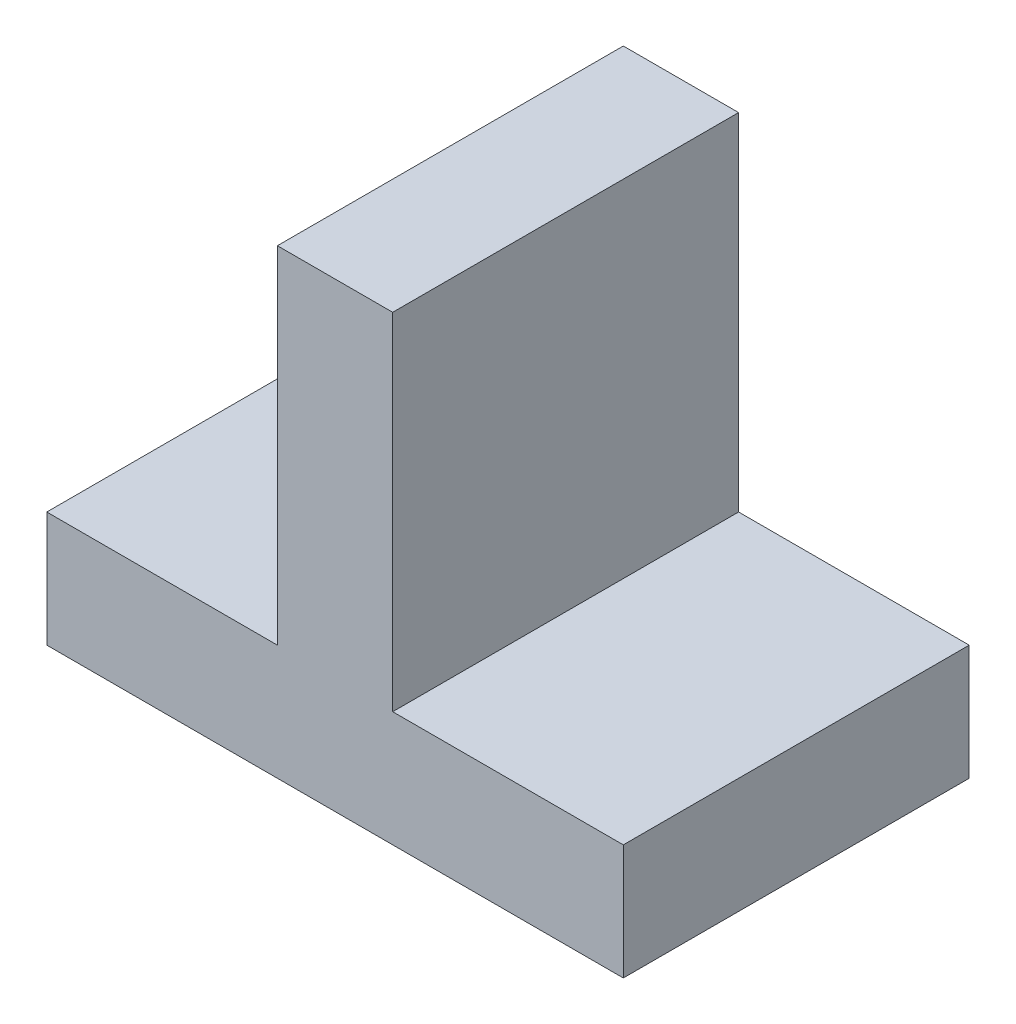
from build123d import *

# Parameters (mm, degrees)
SKETCH_1_W      = 50
SKETCH_1_H      = 30
EXTRUDE_1_DEPTH = 10
SKETCH_4_W      = 10
SKETCH_4_H      = 30
EXTRUDE_2_DEPTH = 15


with BuildPart() as part:
    # Sketch 1 → Extrude 1 (new body)
    with BuildSketch(Plane(origin=(0, 0, 0), x_dir=(1, 0, 0), z_dir=(0, 1, 0))):
        Rectangle(SKETCH_1_W, SKETCH_1_H)
    extrude(amount=EXTRUDE_1_DEPTH)

    # Sketch 4 → Extrude 2 (add, symmetric)
    with BuildSketch(Plane.XY):
        with Locations((0, 25)):
            Rectangle(SKETCH_4_W, SKETCH_4_H)
    extrude(amount=EXTRUDE_2_DEPTH, both=True)


solid = part.part
